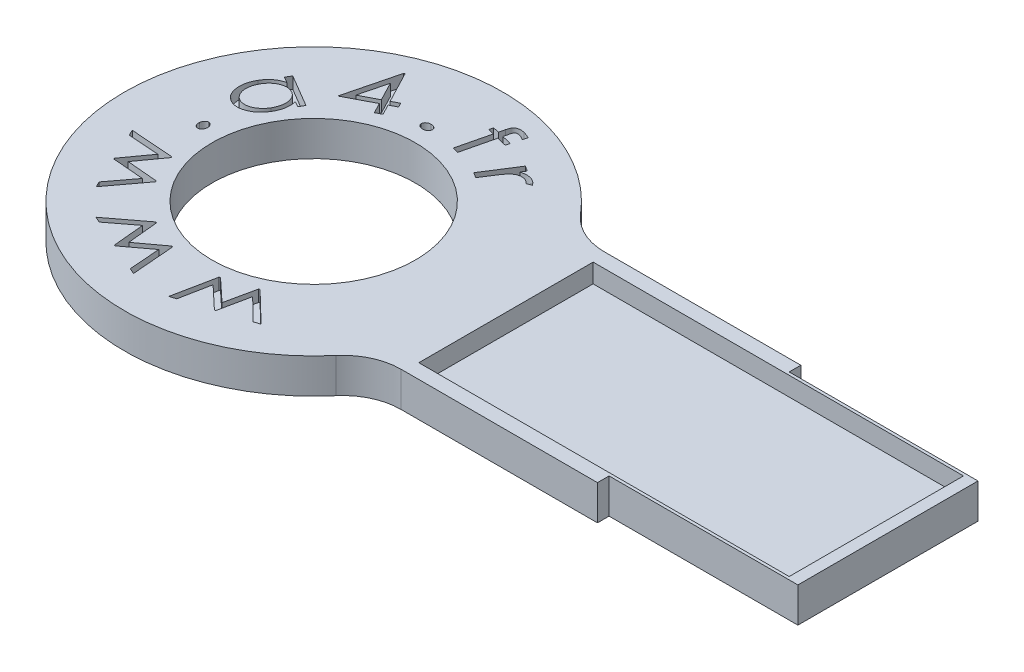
from build123d import *

# Parameters (mm, degrees)
BOSS_EXTRU_1_DEPTH      = 2.4
ESQUISSE2_W             = 25.5
ESQUISSE2_H             = 12
ENL_V_MAT_EXTRU_1_DEPTH = 1.3
ESQUISSE3_R             = 7
ENL_V_MAT_EXTRU_2_DEPTH = 31.597343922
ENL_V_MAT_EXTRU_3_DEPTH = 0.8
CONG_1_R                = 4


with BuildPart() as part:
    # Esquisse1 → Boss.-Extru.1 (new body)
    with BuildSketch(Plane(origin=(0, 0, 0), x_dir=(1, 0, 0), z_dir=(0, 1, 0))):
        with BuildLine():
            Line((25, 6.2), (25, -6.2))
            Line((25, -6.2), (12, -6.2))
            Line((12, -6.2), (12, -7))
            Line((12, -7), (-3.538463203, -7))
            ThreePointArc((-3.538463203, -7), (-27.576179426, 0), (-3.538463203, 7))
            Line((-3.538463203, 7), (12, 7))
            Line((12, 7), (12, 6.2))
            Line((12, 6.2), (25, 6.2))
        make_face()
    extrude(amount=-BOSS_EXTRU_1_DEPTH)

    # Esquisse2 → Enl_v. mat.-Extru.1 (cut)
    with BuildSketch(Plane(origin=(0, 0, 0), x_dir=(1, 0, 0), z_dir=(0, 1, 0))):
        with Locations((11.45, 0)):
            Rectangle(ESQUISSE2_W, ESQUISSE2_H)
    extrude(amount=-ENL_V_MAT_EXTRU_1_DEPTH, mode=Mode.SUBTRACT)

    # Esquisse3 → Enl_v. mat.-Extru.2 (cut, through all)
    with BuildSketch(Plane(origin=(0, 0, 0), x_dir=(1, 0, 0), z_dir=(0, 1, 0))):
        with Locations(Location((-14.538089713, 0, 0), (0, 0, 270))):
            Circle(ESQUISSE3_R)
    extrude(amount=-ENL_V_MAT_EXTRU_2_DEPTH, mode=Mode.SUBTRACT)

    # Esquisse4 → Enl_v. mat.-Extru.3 (cut)
    # profile 1 of 9: a face of its own
    with BuildSketch(Plane(origin=(0, 0, 0), x_dir=(1, 0, 0), z_dir=(0, 1, 0))):
        with BuildLine():
            Line((-9.354679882, 9.393437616), (-8.99079767, 9.162067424))
            Line((-8.99079767, 9.162067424), (-9.192720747, 8.845160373))
            add(Edge.make_bspline(
                [(-9.192720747, 8.845160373), (-9.146876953, 8.857720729), (-9.057610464, 8.882178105), (-8.9239216, 8.90337011), (-8.79555291, 8.913584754), (-8.672355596, 8.908347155), (-8.554452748, 8.891153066), (-8.442135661, 8.860478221), (-8.334492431, 8.818551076), (-8.268628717, 8.779268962), (-8.235689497, 8.759623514)],
                knots=[0, 0, 0, 0, 1.149440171, 2.238176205, 3.270083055, 4.260571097, 5.215548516, 6.14706153, 7.073323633, 8, 8, 8, 8], degree=3))
            add(Edge.make_bspline(
                [(-8.235689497, 8.759623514), (-8.211115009, 8.742965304), (-8.160901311, 8.708927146), (-8.093085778, 8.644063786), (-8.027265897, 8.569862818), (-7.98854683, 8.513747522), (-7.968562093, 8.48478377)],
                knots=[0, 0, 0, 0, 0.921389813, 1.882700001, 2.90716157, 4, 4, 4, 4], degree=3))
            Line((-7.968562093, 8.48478377), (-8.302997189, 8.368397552))
            add(Edge.make_bspline(
                [(-8.302997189, 8.368397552), (-8.317275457, 8.385417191), (-8.344519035, 8.41789143), (-8.38654207, 8.461073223), (-8.426296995, 8.498013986), (-8.454434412, 8.517107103), (-8.467760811, 8.526149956)],
                knots=[0, 0, 0, 0, 1.163702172, 2.220396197, 3.157146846, 4, 4, 4, 4], degree=3))
            add(Edge.make_bspline(
                [(-8.467760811, 8.526149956), (-8.498093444, 8.543610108), (-8.559048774, 8.57869738), (-8.661006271, 8.611693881), (-8.769869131, 8.630006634), (-8.885116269, 8.63269743), (-9.005177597, 8.618049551), (-9.125977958, 8.578453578), (-9.246982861, 8.5176197), (-9.322458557, 8.462799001), (-9.3616911, 8.434303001)],
                knots=[0, 0, 0, 0, 0.873189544, 1.7547292, 2.661705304, 3.626275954, 4.628068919, 5.670495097, 6.789114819, 8, 8, 8, 8], degree=3))
            add(Edge.make_bspline(
                [(-9.3616911, 8.434303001), (-9.378301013, 8.420317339), (-9.414645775, 8.389714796), (-9.468304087, 8.333205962), (-9.527863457, 8.2643627), (-9.592659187, 8.182140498), (-9.663576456, 8.08728809), (-9.739894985, 7.979348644), (-9.82112191, 7.857786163), (-9.87622864, 7.77183879), (-9.905060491, 7.72687111)],
                knots=[0, 0, 0, 0, 0.581910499, 1.273299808, 2.086329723, 3.023027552, 4.0796875, 5.262140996, 6.567551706, 8, 8, 8, 8], degree=3))
            Line((-9.905060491, 7.72687111), (-10.372708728, 6.99279659))
            Line((-10.372708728, 6.99279659), (-10.736590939, 7.224166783))
            Line((-10.736590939, 7.224166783), (-9.354679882, 9.393437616))
        make_face()
    # profile 2 of 9: a face of its own
    with BuildSketch(Plane(origin=(0, 0, 0), x_dir=(1, 0, 0), z_dir=(0, 1, 0))):
        with BuildLine():
            Line((-10.954022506, 11.177387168), (-11.030444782, 10.862583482))
            add(Edge.make_bspline(
                [(-11.030444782, 10.862583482), (-11.063862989, 10.882861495), (-11.127580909, 10.921525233), (-11.222593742, 10.970488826), (-11.312172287, 11.007684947), (-11.371251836, 11.024357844), (-11.399234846, 11.032254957)],
                knots=[0, 0, 0, 0, 1.15060654, 2.193841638, 3.144513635, 4, 4, 4, 4], degree=3))
            add(Edge.make_bspline(
                [(-11.399234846, 11.032254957), (-11.418572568, 11.036330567), (-11.455620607, 11.044138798), (-11.510096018, 11.05006931), (-11.560718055, 11.049488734), (-11.606774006, 11.043151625), (-11.647375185, 11.033039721), (-11.681687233, 11.018955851), (-11.709729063, 11.001892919), (-11.732517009, 10.977569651), (-11.750456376, 10.940079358), (-11.769190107, 10.885577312), (-11.791687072, 10.810279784), (-11.805728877, 10.752586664), (-11.813597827, 10.720255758)],
                knots=[0, 0, 0, 0, 1.140922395, 2.185828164, 3.157745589, 4.056828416, 4.865443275, 5.567315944, 6.192589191, 6.746482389, 7.465028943, 8.570922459, 10.078363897, 12, 12, 12, 12], degree=3))
            Line((-11.813597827, 10.720255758), (-11.895629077, 10.382315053))
            Line((-11.895629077, 10.382315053), (-11.22886225, 10.22105704))
            Line((-11.22886225, 10.22105704), (-11.29546882, 9.944815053))
            Line((-11.29546882, 9.944815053), (-11.965040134, 10.106774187))
            Line((-11.965040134, 10.106774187), (-12.504202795, 7.880011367))
            Line((-12.504202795, 7.880011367), (-12.915060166, 7.979570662))
            Line((-12.915060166, 7.979570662), (-12.375897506, 10.206333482))
            Line((-12.375897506, 10.206333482), (-12.795869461, 10.307996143))
            Line((-12.795869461, 10.307996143), (-12.729262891, 10.58423813))
            Line((-12.729262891, 10.58423813), (-12.309290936, 10.48257547))
            Line((-12.309290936, 10.48257547), (-12.214639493, 10.873801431))
            add(Edge.make_bspline(
                [(-12.214639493, 10.873801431), (-12.209162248, 10.895337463), (-12.198580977, 10.936942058), (-12.181190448, 10.99639047), (-12.162864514, 11.050624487), (-12.144338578, 11.099461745), (-12.124471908, 11.143063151), (-12.103563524, 11.181058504), (-12.082868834, 11.214749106), (-12.052468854, 11.251399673), (-12.008833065, 11.290365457), (-11.948032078, 11.328597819), (-11.877116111, 11.356986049), (-11.798091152, 11.378128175), (-11.710873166, 11.388676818), (-11.617475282, 11.390485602), (-11.518392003, 11.379074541), (-11.45147739, 11.364919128), (-11.416762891, 11.35757547)],
                knots=[0, 0, 0, 0, 0.981960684, 1.897010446, 2.736366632, 3.511230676, 4.204428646, 4.851466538, 5.427330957, 5.948350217, 6.950151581, 7.998924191, 9.105595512, 10.313070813, 11.6043411, 12.978100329, 14.432274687, 16, 16, 16, 16], degree=3))
            add(Edge.make_bspline(
                [(-11.416762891, 11.35757547), (-11.38201404, 11.348270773), (-11.309113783, 11.328750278), (-11.197720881, 11.287413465), (-11.07744524, 11.238239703), (-10.996321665, 11.19824241), (-10.954022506, 11.177387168)],
                knots=[0, 0, 0, 0, 0.86717741, 1.819267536, 2.862930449, 4, 4, 4, 4], degree=3))
        make_face()
    # profile 3 of 9: a face of its own
    with BuildSketch(Plane(origin=(0, 0, 0), x_dir=(1, 0, 0), z_dir=(0, 1, 0))):
        with BuildLine():
            add(Edge.make_bspline(
                [(-15.117548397, 8.644833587), (-15.092742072, 8.645656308), (-15.044235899, 8.647265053), (-14.973496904, 8.635757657), (-14.90767692, 8.613110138), (-14.848661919, 8.579397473), (-14.797647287, 8.53864241), (-14.759053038, 8.490094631), (-14.732892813, 8.435643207), (-14.728060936, 8.396212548), (-14.725621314, 8.376303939)],
                knots=[0, 0, 0, 0, 1.128834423, 2.207317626, 3.244635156, 4.284191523, 5.290487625, 6.200246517, 7.091301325, 8, 8, 8, 8], degree=3))
            add(Edge.make_bspline(
                [(-14.725621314, 8.376303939), (-14.725468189, 8.356526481), (-14.725166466, 8.317556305), (-14.743991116, 8.260843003), (-14.774302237, 8.207102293), (-14.819829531, 8.159899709), (-14.873725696, 8.118571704), (-14.936139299, 8.087496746), (-15.004558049, 8.065940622), (-15.052890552, 8.060681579), (-15.077584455, 8.057994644)],
                knots=[0, 0, 0, 0, 0.898019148, 1.769487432, 2.692677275, 3.697658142, 4.742034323, 5.783129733, 6.867363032, 8, 8, 8, 8], degree=3))
            add(Edge.make_bspline(
                [(-15.077584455, 8.057994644), (-15.102402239, 8.057093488), (-15.150968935, 8.055329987), (-15.221584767, 8.06795313), (-15.287573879, 8.0905724), (-15.346978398, 8.123724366), (-15.397794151, 8.165159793), (-15.435685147, 8.213907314), (-15.462172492, 8.267613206), (-15.467059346, 8.306373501), (-15.469511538, 8.32582317)],
                knots=[0, 0, 0, 0, 1.131582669, 2.214429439, 3.254272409, 4.305668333, 5.306190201, 6.226560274, 7.11009924, 8, 8, 8, 8], degree=3))
            add(Edge.make_bspline(
                [(-15.469511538, 8.32582317), (-15.469617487, 8.345814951), (-15.469827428, 8.385429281), (-15.451661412, 8.442901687), (-15.420543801, 8.496498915), (-15.375349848, 8.54366563), (-15.321377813, 8.584892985), (-15.259125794, 8.616226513), (-15.190436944, 8.636667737), (-15.142218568, 8.642069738), (-15.117548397, 8.644833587)],
                knots=[0, 0, 0, 0, 0.906561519, 1.796379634, 2.708184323, 3.710815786, 4.752750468, 5.791412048, 6.870010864, 8, 8, 8, 8], degree=3))
        make_face()
    # profile 4 of 9: a face of its own
    with BuildSketch(Plane(origin=(0, 0, 0), x_dir=(1, 0, 0), z_dir=(0, 1, 0))):
        Polygon((-19.081800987, 10.710548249), (-19.001873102, 10.752615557), (-17.875170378, 8.596666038), (-17.399108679, 8.845564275), (-17.243459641, 8.548989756), (-17.719521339, 8.300091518), (-17.343720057, 7.580740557), (-17.737049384, 7.375311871), (-18.112850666, 8.094662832), (-19.991857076, 7.112391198), align=None)
        Polygon((-18.268499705, 8.391237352), (-18.942277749, 9.680600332), (-19.425350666, 7.786169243), align=None, mode=Mode.SUBTRACT)
    # profile 5 of 9: a face of its own
    with BuildSketch(Plane(origin=(0, 0, 0), x_dir=(1, 0, 0), z_dir=(0, 1, 0))):
        with BuildLine():
            Line((-22.739947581, 6.75966968), (-20.523000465, 5.453479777))
            Line((-20.523000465, 5.453479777), (-20.734739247, 5.093804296))
            Line((-20.734739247, 5.093804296), (-21.115448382, 5.31816327))
            add(Edge.make_bspline(
                [(-21.115448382, 5.31816327), (-21.103563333, 5.258981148), (-21.079985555, 5.141574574), (-21.064790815, 4.963221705), (-21.067677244, 4.785677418), (-21.088077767, 4.609055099), (-21.12627784, 4.433677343), (-21.181907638, 4.259877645), (-21.255898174, 4.087630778), (-21.317536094, 3.977106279), (-21.34892194, 3.920827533)],
                knots=[0, 0, 0, 0, 0.996588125, 1.977049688, 2.950087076, 3.925587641, 4.909266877, 5.910465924, 6.936015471, 8, 8, 8, 8], degree=3))
            add(Edge.make_bspline(
                [(-21.34892194, 3.920827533), (-21.379059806, 3.872208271), (-21.438416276, 3.776452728), (-21.538469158, 3.642989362), (-21.645569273, 3.52095989), (-21.761672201, 3.41219869), (-21.883365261, 3.31314491), (-22.013822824, 3.227597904), (-22.151348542, 3.15359995), (-22.294385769, 3.091748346), (-22.439538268, 3.043480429), (-22.583229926, 3.010692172), (-22.723813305, 2.994155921), (-22.861500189, 2.993933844), (-22.996078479, 3.010319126), (-23.127618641, 3.04179791), (-23.255636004, 3.090559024), (-23.33635926, 3.134391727), (-23.377267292, 3.156604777)],
                knots=[0, 0, 0, 0, 1.141186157, 2.247563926, 3.32478912, 4.377324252, 5.419003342, 6.452641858, 7.485659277, 8.532349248, 9.558944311, 10.534355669, 11.468733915, 12.378275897, 13.275596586, 14.168189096, 15.071695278, 16, 16, 16, 16], degree=3))
            add(Edge.make_bspline(
                [(-23.377267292, 3.156604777), (-23.415800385, 3.180907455), (-23.492092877, 3.229024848), (-23.593876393, 3.31705763), (-23.684020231, 3.415081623), (-23.760836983, 3.524949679), (-23.825375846, 3.645576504), (-23.878208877, 3.776702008), (-23.917884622, 3.918790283), (-23.945452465, 4.069450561), (-23.960185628, 4.225477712), (-23.960598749, 4.38264001), (-23.948449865, 4.53924396), (-23.92040637, 4.694632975), (-23.879738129, 4.849185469), (-23.825283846, 5.00307215), (-23.756744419, 5.15596295), (-23.701261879, 5.254764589), (-23.67314069, 5.304841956)],
                knots=[0, 0, 0, 0, 0.90899365, 1.799735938, 2.678765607, 3.563430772, 4.469987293, 5.406302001, 6.381712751, 7.411887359, 8.462260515, 9.508058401, 10.547909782, 11.595633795, 12.657841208, 13.737238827, 14.85312507, 16, 16, 16, 16], degree=3))
            add(Edge.make_bspline(
                [(-23.67314069, 5.304841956), (-23.638501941, 5.361000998), (-23.57055248, 5.471165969), (-23.451552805, 5.620201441), (-23.325224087, 5.754468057), (-23.187671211, 5.87057031), (-23.040703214, 5.970172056), (-22.8838208, 6.051551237), (-22.718416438, 6.117518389), (-22.60270454, 6.145895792), (-22.5443346, 6.160210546)],
                knots=[0, 0, 0, 0, 1.084113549, 2.126662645, 3.12970384, 4.111380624, 5.080276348, 6.042886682, 7.012749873, 8, 8, 8, 8], degree=3))
            Line((-22.5443346, 6.160210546), (-22.951686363, 6.3999942))
            Line((-22.951686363, 6.3999942), (-22.739947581, 6.75966968))
        make_face()
        with BuildLine():
            add(Edge.make_bspline(
                [(-23.381474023, 5.171628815), (-23.409533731, 5.121020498), (-23.464935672, 5.021097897), (-23.526568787, 4.862974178), (-23.572506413, 4.702791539), (-23.594584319, 4.566962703), (-23.603093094, 4.458707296), (-23.604561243, 4.379094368), (-23.601081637, 4.301111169), (-23.592684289, 4.224520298), (-23.579331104, 4.149335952), (-23.561191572, 4.075746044), (-23.537888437, 4.003855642), (-23.509894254, 3.93411809), (-23.478032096, 3.8668641), (-23.441428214, 3.804139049), (-23.402229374, 3.7450778), (-23.358188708, 3.691456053), (-23.312387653, 3.640281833), (-23.261640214, 3.595097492), (-23.207839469, 3.553643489), (-23.169483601, 3.529753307), (-23.150103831, 3.517682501)],
                knots=[0, 0, 0, 0, 1.87497974, 3.702016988, 5.489761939, 7.271760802, 8.153686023, 9.01036282, 9.852598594, 10.683813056, 11.507563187, 12.32750312, 13.140122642, 13.95651615, 14.763423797, 15.551308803, 16.310258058, 17.059607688, 17.799970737, 18.53523301, 19.259908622, 20, 20, 20, 20], degree=3))
            add(Edge.make_bspline(
                [(-23.150103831, 3.517682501), (-23.130426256, 3.506569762), (-23.091232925, 3.484435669), (-23.028983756, 3.457652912), (-22.964405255, 3.437216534), (-22.89812539, 3.41969474), (-22.82955511, 3.408744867), (-22.758753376, 3.403236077), (-22.68590276, 3.402630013), (-22.58600219, 3.408174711), (-22.460474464, 3.428208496), (-22.312969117, 3.472539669), (-22.17021724, 3.538416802), (-22.032562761, 3.622091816), (-21.903739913, 3.723950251), (-21.784616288, 3.838894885), (-21.678347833, 3.968343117), (-21.618360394, 4.062954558), (-21.588004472, 4.110831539)],
                knots=[0, 0, 0, 0, 0.587028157, 1.16922888, 1.756979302, 2.346234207, 2.949350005, 3.55867299, 4.19037995, 4.841300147, 6.157401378, 7.483249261, 8.83141943, 10.232473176, 11.660144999, 13.090488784, 14.52767685, 16, 16, 16, 16], degree=3))
            add(Edge.make_bspline(
                [(-21.588004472, 4.110831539), (-21.560169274, 4.160969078), (-21.504857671, 4.260597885), (-21.443464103, 4.419301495), (-21.396991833, 4.581844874), (-21.373292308, 4.720383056), (-21.362965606, 4.831425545), (-21.359766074, 4.912685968), (-21.363014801, 4.991572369), (-21.369692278, 5.068181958), (-21.381586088, 5.142466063), (-21.398470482, 5.214402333), (-21.420324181, 5.28396344), (-21.446569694, 5.351222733), (-21.478758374, 5.414907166), (-21.513146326, 5.476334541), (-21.553659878, 5.533151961), (-21.597856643, 5.58667455), (-21.646454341, 5.636543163), (-21.698988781, 5.682984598), (-21.75628841, 5.725222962), (-21.796767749, 5.750548), (-21.817271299, 5.76337561)],
                knots=[0, 0, 0, 0, 1.852333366, 3.68079028, 5.486921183, 7.311923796, 8.21501296, 9.092119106, 9.939016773, 10.766163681, 11.577417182, 12.36925691, 13.153196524, 13.933412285, 14.700563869, 15.45884332, 16.207306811, 16.953286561, 17.701444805, 18.456403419, 19.218139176, 20, 20, 20, 20], degree=3))
            add(Edge.make_bspline(
                [(-21.817271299, 5.76337561), (-21.849378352, 5.780992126), (-21.91245332, 5.815600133), (-22.012731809, 5.853458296), (-22.114497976, 5.879663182), (-22.218818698, 5.89340342), (-22.324999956, 5.892841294), (-22.433063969, 5.880675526), (-22.543209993, 5.856838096), (-22.653471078, 5.819368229), (-22.76231681, 5.772004), (-22.867309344, 5.714974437), (-22.967198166, 5.648535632), (-23.060600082, 5.570951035), (-23.149962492, 5.485871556), (-23.232860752, 5.390142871), (-23.311219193, 5.285568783), (-23.357746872, 5.210109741), (-23.381474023, 5.171628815)],
                knots=[0, 0, 0, 0, 0.943464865, 1.853456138, 2.755368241, 3.648701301, 4.558772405, 5.4865721, 6.448849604, 7.458972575, 8.484618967, 9.506753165, 10.5364467, 11.572838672, 12.634217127, 13.714859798, 14.834674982, 16, 16, 16, 16], degree=3))
        make_face(mode=Mode.SUBTRACT)
    # profile 6 of 9: a face of its own
    with BuildSketch(Plane(origin=(0, 0, 0), x_dir=(1, 0, 0), z_dir=(0, 1, 0))):
        with BuildLine():
            add(Edge.make_bspline(
                [(-23.178521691, 0.76326768), (-23.175647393, 0.787980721), (-23.170068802, 0.835945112), (-23.147485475, 0.903605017), (-23.115711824, 0.964843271), (-23.074542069, 1.01855001), (-23.026593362, 1.062854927), (-22.97247735, 1.093068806), (-22.91482641, 1.110661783), (-22.875287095, 1.109970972), (-22.855304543, 1.109621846)],
                knots=[0, 0, 0, 0, 1.134990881, 2.202850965, 3.240061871, 4.276667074, 5.283032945, 6.201601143, 7.091117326, 8, 8, 8, 8], degree=3))
            add(Edge.make_bspline(
                [(-22.855304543, 1.109621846), (-22.835869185, 1.106871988), (-22.797180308, 1.101397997), (-22.743501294, 1.075307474), (-22.695081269, 1.037087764), (-22.654965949, 0.985822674), (-22.622158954, 0.926675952), (-22.599234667, 0.861352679), (-22.588587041, 0.790701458), (-22.590631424, 0.74248835), (-22.591682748, 0.717694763)],
                knots=[0, 0, 0, 0, 0.895614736, 1.782850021, 2.698639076, 3.704832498, 4.746049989, 5.790243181, 6.863632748, 8, 8, 8, 8], degree=3))
            add(Edge.make_bspline(
                [(-22.591682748, 0.717694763), (-22.594699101, 0.693260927), (-22.600598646, 0.645471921), (-22.621522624, 0.57720553), (-22.654671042, 0.516158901), (-22.696056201, 0.462476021), (-22.744654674, 0.419202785), (-22.797442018, 0.387719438), (-22.85469943, 0.370356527), (-22.893759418, 0.37101025), (-22.913497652, 0.371340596)],
                knots=[0, 0, 0, 0, 1.127832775, 2.205875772, 3.2512399, 4.297537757, 5.299812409, 6.217163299, 7.099076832, 8, 8, 8, 8], degree=3))
            add(Edge.make_bspline(
                [(-22.913497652, 0.371340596), (-22.933411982, 0.374035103), (-22.972601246, 0.379337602), (-23.027029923, 0.405778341), (-23.075362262, 0.444328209), (-23.116027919, 0.495218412), (-23.149341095, 0.554197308), (-23.169390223, 0.620269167), (-23.182055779, 0.690361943), (-23.179725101, 0.738442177), (-23.178521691, 0.76326768)],
                knots=[0, 0, 0, 0, 0.91412739, 1.798904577, 2.727174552, 3.72228873, 4.760621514, 5.805263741, 6.866781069, 8, 8, 8, 8], degree=3))
        make_face()
    # profile 7 of 9: a face of its own
    with BuildSketch(Plane(origin=(0, 0, 0), x_dir=(1, 0, 0), z_dir=(0, 1, 0))):
        Polygon((-22.900314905, -6.616265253), (-23.08190545, -6.221533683), (-21.805162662, -4.529726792), (-23.941480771, -4.353745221), (-23.97233013, -4.285736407), (-22.715218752, -2.551862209), (-24.838215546, -2.40392551), (-25.021909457, -2.004286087), (-22.091921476, -2.221633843), (-22.057566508, -2.295952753), (-23.294345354, -4.013000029), (-21.181865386, -4.199498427), (-21.148912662, -4.270311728), align=None)
    # profile 8 of 9: a face of its own
    with BuildSketch(Plane(origin=(0, 0, 0), x_dir=(1, 0, 0), z_dir=(0, 1, 0))):
        Polygon((-16.443198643, -10.501209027), (-16.8407347, -10.325227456), (-17.001291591, -8.204334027), (-18.723947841, -9.49089252), (-18.792657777, -9.460744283), (-18.994580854, -7.320920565), (-20.689192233, -8.620099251), (-21.092337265, -8.441313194), (-18.743579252, -6.659061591), (-18.66855922, -6.692014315), (-18.462429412, -8.805195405), (-16.750289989, -7.541773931), (-16.678074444, -7.574025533), align=None)
    # profile 9 of 9: a face of its own
    with BuildSketch(Plane(origin=(0, 0, 0), x_dir=(1, 0, 0), z_dir=(0, 1, 0))):
        Polygon((-9.02779728, -9.133099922), (-9.440758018, -9.262807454), (-10.959387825, -7.782038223), (-11.398290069, -9.880495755), (-11.470505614, -9.902931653), (-13.031202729, -8.434782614), (-13.442060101, -10.524826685), (-13.861330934, -10.657338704), (-13.280100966, -7.774325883), (-13.202977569, -7.749786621), (-11.655601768, -9.19479864), (-11.208286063, -7.120880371), (-11.13326603, -7.097743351), align=None)
    extrude(amount=-ENL_V_MAT_EXTRU_3_DEPTH, mode=Mode.SUBTRACT)

    # Cong_1
    cong_1_edges = [part.edges().sort_by_distance(p)[0] for p in [
        (-3.538463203, -1.2, 7),
        (-3.538463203, -1.2, -7),
    ]]
    fillet(cong_1_edges, radius=CONG_1_R)


solid = part.part
